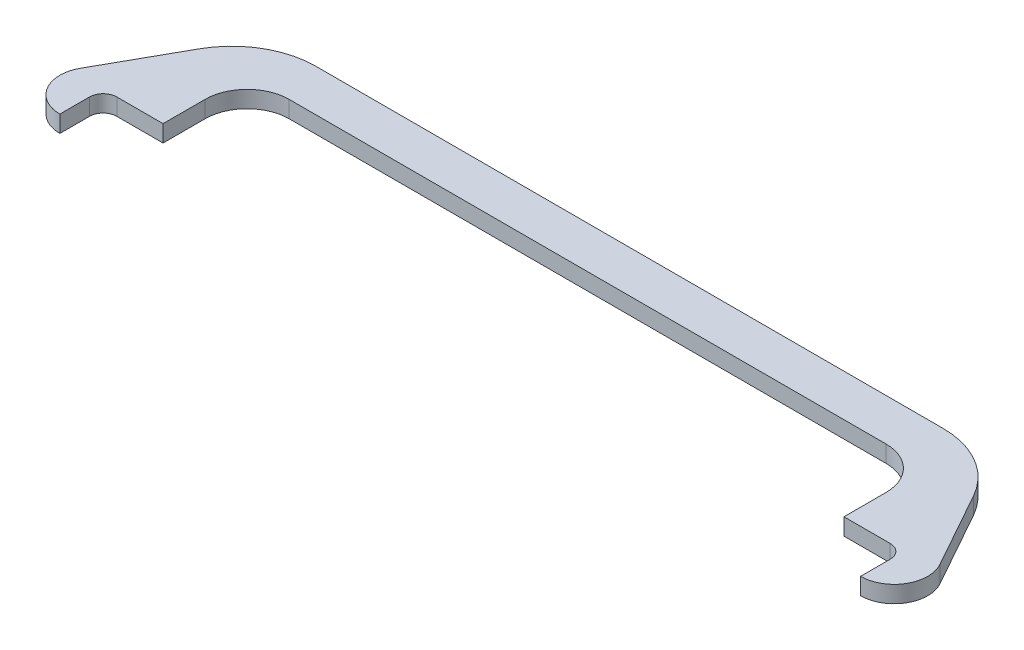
from build123d import *

# Parameters (mm, degrees)
EXTRUSION1_DEPTH = 8


with BuildPart() as part:
    # Esquisse2 → Extrusion1 (new body)
    with BuildSketch(Plane(origin=(0, 0, 0), x_dir=(1, 0, 0), z_dir=(0, 1, 0))):
        with BuildLine():
            Line((-142, 0), (142, 0))
            ThreePointArc((142, 0), (156.142135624, -5.857864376), (162, -20))
            Line((162, -20), (162, -40))
            Line((162, -40), (184, -40))
            ThreePointArc((184, -40), (188.596194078, -41.903805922), (190.5, -46.5))
            Line((190.5, -46.5), (190.5, -60.6))
            ThreePointArc((190.5, -60.6), (204.300218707, -52.696540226), (204.466753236, -36.794245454))
            Line((204.466753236, -36.794245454), (184.174544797, -0.485613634))
            ThreePointArc((184.174544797, -0.485613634), (169.499012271, 14.500546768), (149.257661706, 20))
            Line((149.257661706, 20), (-149.257661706, 20))
            ThreePointArc((-149.257661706, 20), (-169.499012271, 14.500546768), (-184.174544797, -0.485613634))
            Line((-184.174544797, -0.485613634), (-204.466753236, -36.794245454))
            ThreePointArc((-204.466753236, -36.794245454), (-204.300218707, -52.696540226), (-190.5, -60.6))
            Line((-190.5, -60.6), (-190.5, -46.5))
            ThreePointArc((-190.5, -46.5), (-188.596194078, -41.903805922), (-184, -40))
            Line((-184, -40), (-162, -40))
            Line((-162, -40), (-162, -20))
            ThreePointArc((-162, -20), (-156.142135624, -5.857864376), (-142, 0))
        make_face()
    extrude(amount=EXTRUSION1_DEPTH)


solid = part.part
